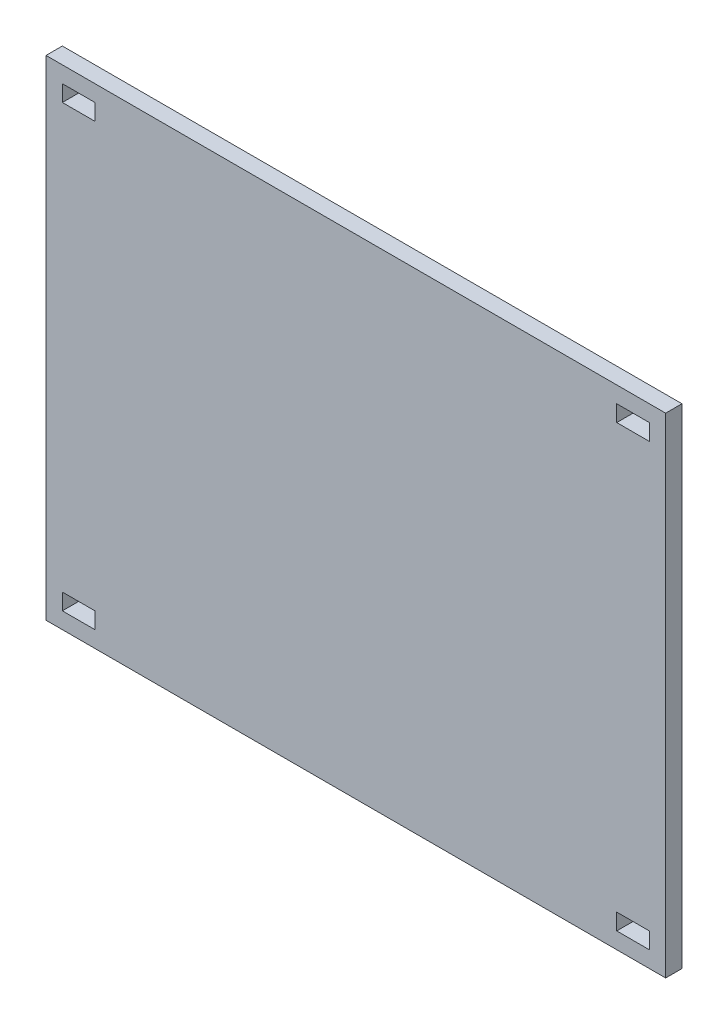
from build123d import *

# Parameters (mm, degrees)
SKETCH1_W           = 120.65
SKETCH1_H           = 95.25
SKETCH1_W_2         = 6.35
SKETCH1_H_2         = 3.175
BOSS_EXTRUDE1_DEPTH = 3.175


with BuildPart() as part:
    # Sketch1 → Boss-Extrude1 (new body)
    with BuildSketch(Plane.XY):
        with Locations((60.325, 47.625)):
            Rectangle(SKETCH1_W, SKETCH1_H)
        with Locations((6.35, 4.7625)):
            Rectangle(SKETCH1_W_2, SKETCH1_H_2, mode=Mode.SUBTRACT)
        with Locations((6.35, 90.4875)):
            Rectangle(SKETCH1_W_2, SKETCH1_H_2, mode=Mode.SUBTRACT)
        with Locations((114.3, 4.7625)):
            Rectangle(SKETCH1_W_2, SKETCH1_H_2, mode=Mode.SUBTRACT)
        with Locations((114.3, 90.4875)):
            Rectangle(SKETCH1_W_2, SKETCH1_H_2, mode=Mode.SUBTRACT)
    extrude(amount=BOSS_EXTRUDE1_DEPTH)


solid = part.part
